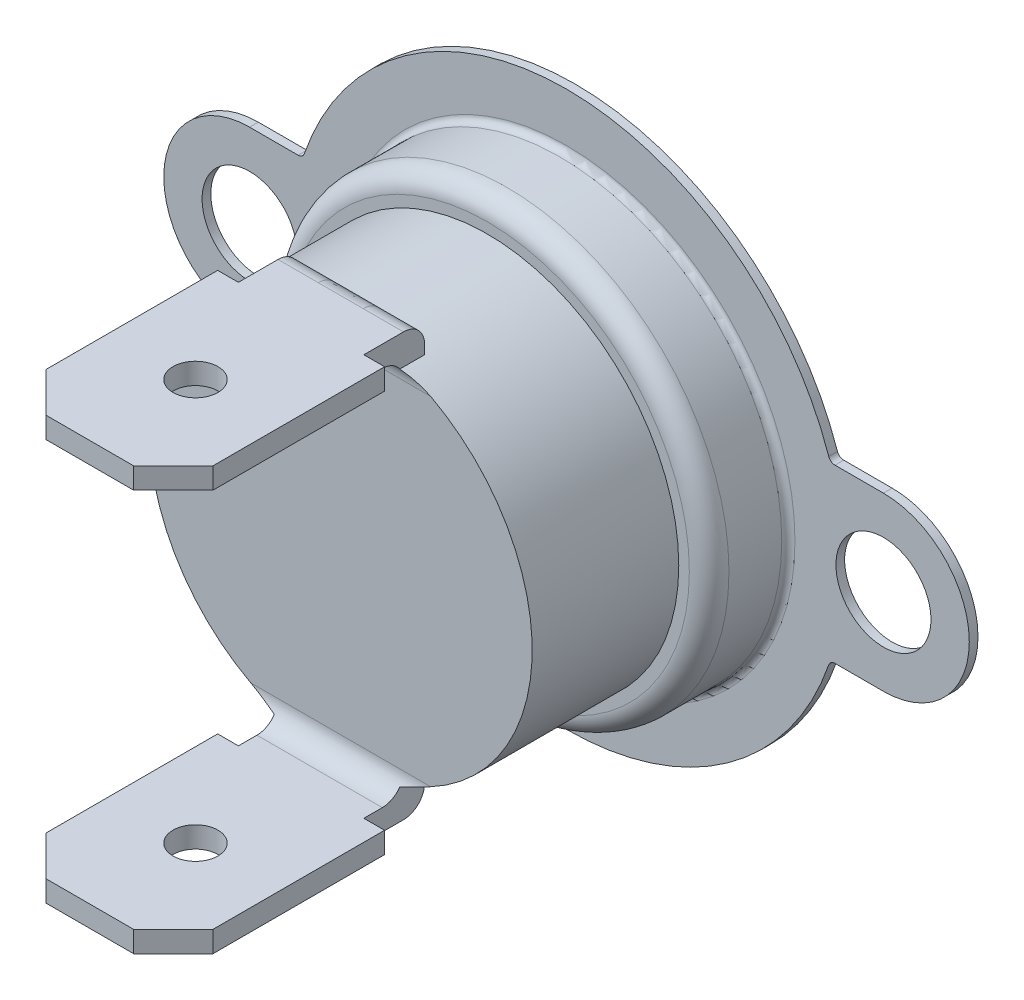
from build123d import *

# Parameters (mm, degrees)
ESQUISSE1_R             = 1.8
BOSS_EXTRU_1_DEPTH      = 0.33
CONG_1_R                = 0.25
ESQUISSE2_R             = 8.4
BOSS_EXTRU_2_DEPTH      = 3
ESQUISSE3_R             = 7.25
BOSS_EXTRU_3_DEPTH      = 5.55
CONG_2_R                = 0.25
CONG_3_R                = 0.75
BOSS_EXTRU_4_DEPTH      = 8
BOSS_EXTRU_4_DEPTH_BACK = 8
ESQUISSE4_W             = 4.75
ESQUISSE4_H             = 0.8
ESQUISSE6_W             = 4.75
ESQUISSE6_H             = 0.8
BOSS_EXTRU_5_DEPTH      = 1.5
ESQUISSE7_W             = 6.32
ESQUISSE7_H             = 0.8
BOSS_EXTRU_6_DEPTH      = 8
CONG_4_R                = 0.8
CHANFREIN1_SIZE         = 1.5
ESQUISSE8_R             = 0.85
ENL_V_MAT_EXTRU_1_DEPTH = 31.209880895


with BuildPart() as part:
    # Esquisse1 → Boss.-Extru.1 (new body)
    with BuildSketch(Plane.XY):
        with BuildLine():
            Line((-12, 3.25), (-9.984362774, 3.25))
            ThreePointArc((-9.984362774, 3.25), (0, 10.5), (9.984362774, 3.25))
            Line((9.984362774, 3.25), (12, 3.25))
            ThreePointArc((12, 3.25), (15.25, 0), (12, -3.25))
            Line((12, -3.25), (9.984362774, -3.25))
            ThreePointArc((9.984362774, -3.25), (0, -10.5), (-9.984362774, -3.25))
            Line((-9.984362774, -3.25), (-12, -3.25))
            ThreePointArc((-12, -3.25), (-15.25, 0), (-12, 3.25))
        make_face()
        with Locations((-12, 0)):
            Circle(ESQUISSE1_R, mode=Mode.SUBTRACT)
        with Locations((12, 0)):
            Circle(ESQUISSE1_R, mode=Mode.SUBTRACT)
    extrude(amount=BOSS_EXTRU_1_DEPTH)

    # Cong_1
    cong_1_edges = [part.edges().sort_by_distance(p)[0] for p in [
        (-9.984362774, 3.25, 0.165),
        (9.984362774, 3.25, 0.165),
        (9.984362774, -3.25, 0.165),
        (-9.984362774, -3.25, 0.165),
    ]]
    fillet(cong_1_edges, radius=CONG_1_R)

    # Esquisse2 → Boss.-Extru.2 (add)
    with BuildSketch(Plane.XY.offset(0.33)):
        Circle(ESQUISSE2_R)
    extrude(amount=BOSS_EXTRU_2_DEPTH)

    # Esquisse3 → Boss.-Extru.3 (add)
    with BuildSketch(Plane.XY.offset(3.33)):
        Circle(ESQUISSE3_R)
    extrude(amount=BOSS_EXTRU_3_DEPTH)

    # Cong_2
    cong_2_edges = [part.edges().sort_by_distance(p)[0] for p in [
        (-8.4, 0, 0.33),
    ]]
    fillet(cong_2_edges, radius=CONG_2_R)

    # Cong_3
    cong_3_edges = [part.edges().sort_by_distance(p)[0] for p in [
        (-8.4, 0, 3.33),
    ]]
    fillet(cong_3_edges, radius=CONG_3_R)

    # Esquisse4 → Boss.-Extru.4 (add, two sides: drawn at the far end of the back side and taken through both)
    with BuildSketch(Plane(origin=(0, 0, 0), x_dir=(1, 0, 0), z_dir=(0, 1, 0)).offset(-BOSS_EXTRU_4_DEPTH_BACK)):
        with Locations((0, -8.48)):
            Rectangle(ESQUISSE4_W, ESQUISSE4_H)
    extrude(amount=BOSS_EXTRU_4_DEPTH + BOSS_EXTRU_4_DEPTH_BACK)

    # Esquisse6 → Boss.-Extru.5 (add)
    with BuildSketch(Plane.XY.offset(8.88)):
        with Locations((0, 7.6)):
            Rectangle(ESQUISSE6_W, ESQUISSE6_H)
        with Locations((0, -7.6)):
            Rectangle(ESQUISSE6_W, ESQUISSE6_H)
    extrude(amount=BOSS_EXTRU_5_DEPTH)

    # Esquisse7 → Boss.-Extru.6 (add)
    with BuildSketch(Plane.XY.offset(10.38)):
        with Locations((0, 7.6)):
            Rectangle(ESQUISSE7_W, ESQUISSE7_H)
        with Locations((0, -7.6)):
            Rectangle(ESQUISSE7_W, ESQUISSE7_H)
    extrude(amount=BOSS_EXTRU_6_DEPTH)

    # Cong_4
    cong_4_edges = [part.edges().sort_by_distance(p)[0] for p in [
        (0, -7.2, 8.88),
        (0, 8, 8.08),
        (0, -8, 8.08),
        (0, 7.2, 8.88),
    ]]
    fillet(cong_4_edges, radius=CONG_4_R)

    # Chanfrein1
    chanfrein1_edges = [part.edges().sort_by_distance(p)[0] for p in [
        (3.16, 7.6, 18.38),
        (-3.16, 7.6, 18.38),
        (-3.16, -7.6, 18.38),
        (3.16, -7.6, 18.38),
    ]]
    chamfer(chanfrein1_edges, length=CHANFREIN1_SIZE)

    # Esquisse8 → Enl_v. mat.-Extru.1 (cut, through all)
    with BuildSketch(Plane(origin=(0, 8, 0), x_dir=(1, 0, 0), z_dir=(0, 1, 0))):
        with Locations(Location((0, -14.38, 0), (0, 0, 270))):
            Circle(ESQUISSE8_R)
    extrude(amount=-ENL_V_MAT_EXTRU_1_DEPTH, mode=Mode.SUBTRACT)


solid = part.part
